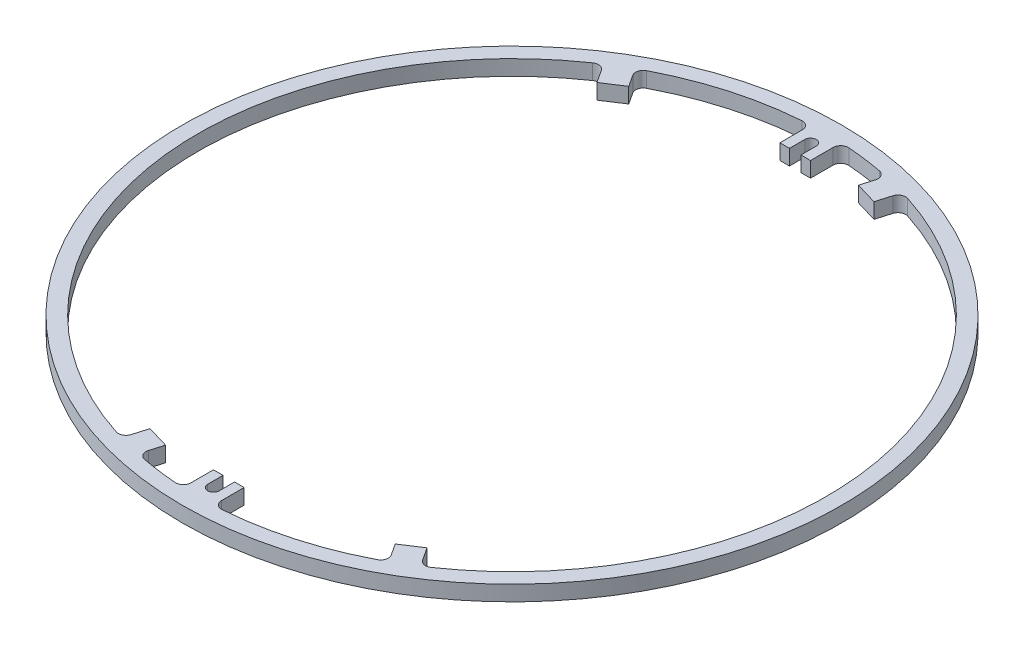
from build123d import *

# Parameters (mm, degrees)
SKETCH_1_R          = 43
SKETCH_1_R_2        = 41
EXTRUDE_1_DEPTH     = 2
EXTRUDE_START       = -2
SKETCH_2_R          = 0.75
EXTRUDE_2_DEPTH     = 2
FILLET_1_R          = 1
FILLET_2_R          = 1
CUT_EXTRUDE_1_DEPTH = 61.844062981
EXTRUDE_3_DEPTH     = 2
FILLET_4_R          = 1
FILLET_6_R          = 1
EXTRUDE_4_DEPTH     = 2
FILLET_7_R          = 1


with BuildPart() as part:
    # Sketch 1 → Extrude 1 (new body)
    with BuildSketch(Plane(origin=(0, 0, 0), x_dir=(1, 0, 0), z_dir=(0, 1, 0))):
        with Locations(Location((0, 0, 0), (0, 0, 270))):
            Circle(SKETCH_1_R)
        with Locations(Location((0, 0, 0), (0, 0, 270))):
            Circle(SKETCH_1_R_2, mode=Mode.SUBTRACT)
    extrude(amount=EXTRUDE_1_DEPTH)

    # Sketch 2 → Extrude 2 (add)
    # profile 1 of 2: a face of its own
    with BuildSketch(Plane(origin=(0, 2, 0), x_dir=(1, 0, 0), z_dir=(0, 1, 0)).offset(EXTRUDE_START)):
        with BuildLine():
            ThreePointArc((2, 40.951190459), (0, 41), (-2, 40.951190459))
            Line((-2, 40.951190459), (-2, 36.951190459))
            Line((-2, 36.951190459), (2, 36.951190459))
            Line((2, 36.951190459), (2, 40.951190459))
        make_face()
        with Locations(Location((0, 38.951190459, 0), (0, 0, 270))):
            Circle(SKETCH_2_R, mode=Mode.SUBTRACT)
    # profile 2 of 2: a face of its own
    with BuildSketch(Plane(origin=(0, 2, 0), x_dir=(1, 0, 0), z_dir=(0, 1, 0)).offset(EXTRUDE_START)):
        with BuildLine():
            Line((-2, -36.951190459), (-2, -40.951190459))
            ThreePointArc((-2, -40.951190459), (0, -41), (2, -40.951190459))
            Line((2, -40.951190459), (2, -36.951190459))
            Line((2, -36.951190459), (-2, -36.951190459))
        make_face()
    extrude(amount=EXTRUDE_2_DEPTH)

    # Fillet 1
    fillet_1_edges = [part.edges().sort_by_distance(p)[0] for p in [
        (-2, 1, -40.951190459),
        (2, 1, -40.951190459),
    ]]
    fillet(fillet_1_edges, radius=FILLET_1_R)

    # Fillet 2
    fillet_2_edges = [part.edges().sort_by_distance(p)[0] for p in [
        (-2, 1, 40.951190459),
        (2, 1, 40.951190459),
    ]]
    fillet(fillet_2_edges, radius=FILLET_2_R)

    # Sketch 3 → Cut-Extrude 1 (cut, through all)
    with BuildSketch(Plane(origin=(0, 2, 0), x_dir=(1, 0, 0), z_dir=(0, 1, 0))):
        with BuildLine():
            Line((-0.75, 38.951190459), (-0.75, 35.951190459))
            Line((-0.75, 35.951190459), (0.75, 35.951190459))
            Line((0.75, 35.951190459), (0.75, 38.951190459))
            ThreePointArc((0.75, 38.951190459), (0, 39.701190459), (-0.75, 38.951190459))
        make_face()
        with BuildLine():
            Line((0.75, -35.951190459), (0.75, -38.951190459))
            ThreePointArc((0.75, -38.951190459), (0, -39.701190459), (-0.75, -38.951190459))
            Line((-0.75, -38.951190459), (-0.75, -35.951190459))
            Line((-0.75, -35.951190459), (0.75, -35.951190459))
        make_face()
    extrude(amount=-CUT_EXTRUDE_1_DEPTH, mode=Mode.SUBTRACT)

    # Sketch 4 → Extrude 3 (add)
    with BuildSketch(Plane(origin=(0, 2, 0), x_dir=(1, 0, 0), z_dir=(0, 1, 0)).offset(EXTRUDE_START)):
        with BuildLine():
            Line((-11.644629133, -39.31160913), (-10.792583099, -36.435149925))
            Line((-10.792583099, -36.435149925), (-7.916123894, -37.287195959))
            Line((-7.916123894, -37.287195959), (-8.736955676, -40.058277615))
            ThreePointArc((-8.736955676, -40.058277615), (-10.197628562, -39.71156471), (-11.644629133, -39.31160913))
        make_face()
        with BuildLine():
            Line((11.644629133, 39.31160913), (10.792583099, 36.435149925))
            Line((10.792583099, 36.435149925), (7.916123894, 37.287195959))
            Line((7.916123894, 37.287195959), (8.736955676, 40.058277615))
            ThreePointArc((8.736955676, 40.058277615), (10.197628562, 39.71156471), (11.644629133, 39.31160913))
        make_face()
    extrude(amount=EXTRUDE_3_DEPTH)

    # Fillet 4
    fillet_4_edges = [part.edges().sort_by_distance(p)[0] for p in [
        (-8.736955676, 1, 40.058277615),
        (-11.644629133, 1, 39.31160913),
    ]]
    fillet(fillet_4_edges, radius=FILLET_4_R)

    # Fillet 6
    fillet_6_edges = [part.edges().sort_by_distance(p)[0] for p in [
        (8.736955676, 1, -40.058277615),
        (11.644629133, 1, -39.31160913),
    ]]
    fillet(fillet_6_edges, radius=FILLET_6_R)

    # Sketch 5 → Extrude 4 (add)
    with BuildSketch(Plane.XZ):
        with BuildLine():
            Line((22.390180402, 34.346467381), (20.751874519, 31.833311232))
            Line((20.751874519, 31.833311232), (18.238718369, 33.471617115))
            Line((18.238718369, 33.471617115), (19.81700579, 35.89270513))
            ThreePointArc((19.81700579, 35.89270513), (21.117749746, 35.143145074), (22.390180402, 34.346467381))
        make_face()
        with BuildLine():
            Line((-18.238718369, -33.471617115), (-19.81700579, -35.89270513))
            ThreePointArc((-19.81700579, -35.89270513), (-21.117749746, -35.143145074), (-22.390180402, -34.346467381))
            Line((-22.390180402, -34.346467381), (-20.751874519, -31.833311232))
            Line((-20.751874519, -31.833311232), (-18.238718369, -33.471617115))
        make_face()
    extrude(amount=-EXTRUDE_4_DEPTH)

    # Fillet 7
    fillet_7_edges = [part.edges().sort_by_distance(p)[0] for p in [
        (22.390180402, 1, 34.346467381),
        (19.81700579, 1, 35.89270513),
        (-22.390180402, 1, -34.346467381),
        (-19.81700579, 1, -35.89270513),
    ]]
    fillet(fillet_7_edges, radius=FILLET_7_R)


solid = part.part
